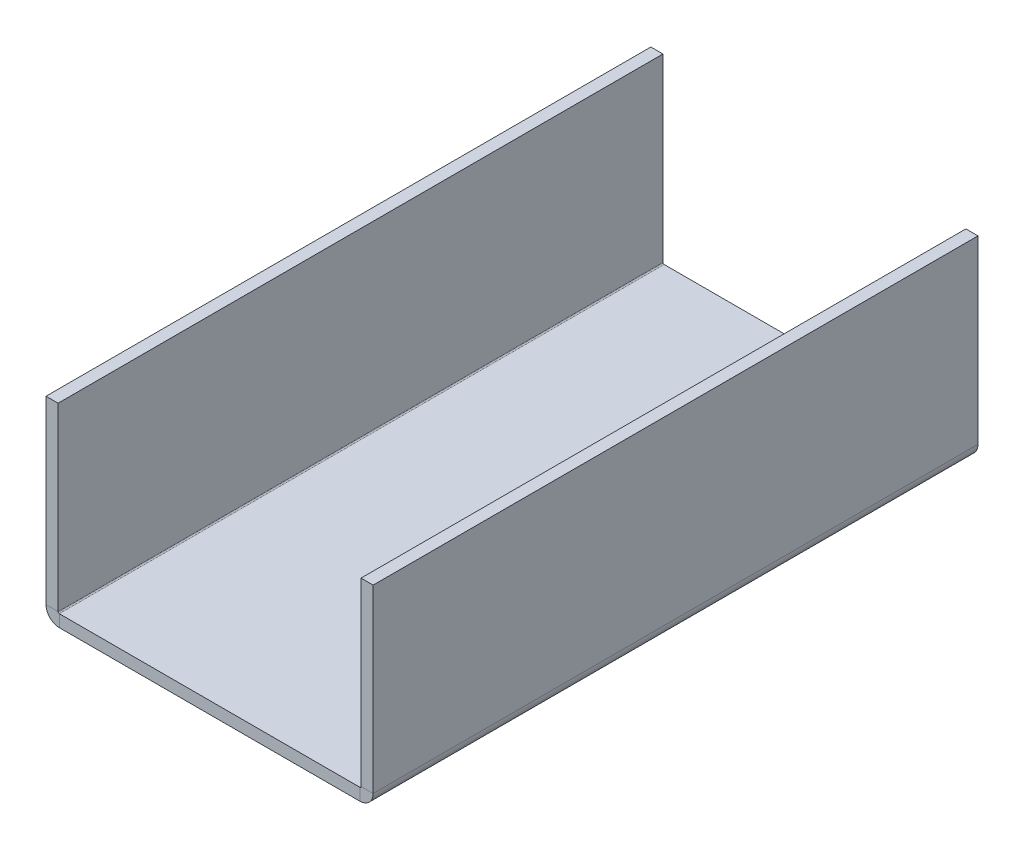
ISO-10303-21;
HEADER;
FILE_DESCRIPTION(('STEP AP214'),'2;1');
FILE_NAME('part.step','',(''),(''),'','','');
FILE_SCHEMA(('AUTOMOTIVE_DESIGN { 1 0 10303 214 1 1 1 1 }'));
ENDSEC;
DATA;
#1=APPLICATION_CONTEXT('core data for automotive mechanical design processes');
#2=APPLICATION_PROTOCOL_DEFINITION('international standard','automotive_design',2000,#1);
#3=PRODUCT_CONTEXT('',#1,'mechanical');
#4=PRODUCT('Part','Part','',(#3));
#5=PRODUCT_RELATED_PRODUCT_CATEGORY('part','',(#4));
#6=PRODUCT_DEFINITION_FORMATION('','',#4);
#7=PRODUCT_DEFINITION_CONTEXT('part definition',#1,'design');
#8=PRODUCT_DEFINITION('design','',#6,#7);
#9=PRODUCT_DEFINITION_SHAPE('','',#8);
#10=(LENGTH_UNIT() NAMED_UNIT(*) SI_UNIT(.MILLI.,.METRE.));
#11=(NAMED_UNIT(*) PLANE_ANGLE_UNIT() SI_UNIT($,.RADIAN.));
#12=(NAMED_UNIT(*) SI_UNIT($,.STERADIAN.) SOLID_ANGLE_UNIT());
#13=UNCERTAINTY_MEASURE_WITH_UNIT(LENGTH_MEASURE(1.E-05),#10,'distance_accuracy_value','');
#14=(GEOMETRIC_REPRESENTATION_CONTEXT(3) GLOBAL_UNCERTAINTY_ASSIGNED_CONTEXT((#13)) GLOBAL_UNIT_ASSIGNED_CONTEXT((#10,
#11,#12)) REPRESENTATION_CONTEXT('',''));
#15=CARTESIAN_POINT('',(0.,0.,0.));
#16=DIRECTION('',(0.,0.,1.));
#17=DIRECTION('',(1.,0.,0.));
#18=AXIS2_PLACEMENT_3D('',#15,#16,#17);
#19=CARTESIAN_POINT('',(0.,1.,-50.));
#20=DIRECTION('',(0.,-1.,0.));
#21=DIRECTION('',(0.,0.,-1.));
#22=AXIS2_PLACEMENT_3D('',#19,#20,#21);
#23=PLANE('',#22);
#24=DIRECTION('',(1.,0.,0.));
#25=VECTOR('',#24,1.);
#26=CARTESIAN_POINT('',(0.,1.,0.));
#27=LINE('',#26,#25);
#28=CARTESIAN_POINT('',(15.0785476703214,1.,0.));
#29=VERTEX_POINT('',#28);
#30=CARTESIAN_POINT('',(39.9214523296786,0.999999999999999,0.));
#31=VERTEX_POINT('',#30);
#32=EDGE_CURVE('E45',#29,#31,#27,.T.);
#33=ORIENTED_EDGE('',*,*,#32,.T.);
#34=DIRECTION('',(0.,0.,-1.));
#35=VECTOR('',#34,1.);
#36=CARTESIAN_POINT('',(39.9214523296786,1.,-50.));
#37=LINE('',#36,#35);
#38=CARTESIAN_POINT('',(39.9214523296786,0.999999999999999,-50.));
#39=VERTEX_POINT('',#38);
#40=EDGE_CURVE('E237',#31,#39,#37,.T.);
#41=ORIENTED_EDGE('',*,*,#40,.T.);
#42=DIRECTION('',(-1.,0.,0.));
#43=VECTOR('',#42,1.);
#44=CARTESIAN_POINT('',(0.,1.,-50.));
#45=LINE('',#44,#43);
#46=CARTESIAN_POINT('',(15.0785476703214,1.,-50.));
#47=VERTEX_POINT('',#46);
#48=EDGE_CURVE('E229',#39,#47,#45,.T.);
#49=ORIENTED_EDGE('',*,*,#48,.T.);
#50=DIRECTION('',(0.,0.,-1.));
#51=VECTOR('',#50,1.);
#52=CARTESIAN_POINT('',(15.0785476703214,1.,-50.));
#53=LINE('',#52,#51);
#54=EDGE_CURVE('E225',#29,#47,#53,.T.);
#55=ORIENTED_EDGE('',*,*,#54,.F.);
#56=EDGE_LOOP('',(#33,#41,#49,#55));
#57=FACE_BOUND('',#56,.T.);
#58=ADVANCED_FACE('F41',(#57),#23,.F.);
#59=CARTESIAN_POINT('',(0.,1.,-50.));
#60=DIRECTION('',(0.,0.,1.));
#61=DIRECTION('',(1.,0.,0.));
#62=AXIS2_PLACEMENT_3D('',#59,#60,#61);
#63=PLANE('',#62);
#64=ORIENTED_EDGE('',*,*,#48,.F.);
#65=DIRECTION('',(0.,-1.,0.));
#66=VECTOR('',#65,1.);
#67=CARTESIAN_POINT('',(39.9214523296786,1.,-50.));
#68=LINE('',#67,#66);
#69=CARTESIAN_POINT('',(39.9214523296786,0.,-50.));
#70=VERTEX_POINT('',#69);
#71=EDGE_CURVE('E12',#39,#70,#68,.T.);
#72=ORIENTED_EDGE('',*,*,#71,.T.);
#73=DIRECTION('',(-1.,0.,0.));
#74=VECTOR('',#73,1.);
#75=CARTESIAN_POINT('',(0.,0.,-50.));
#76=LINE('',#75,#74);
#77=CARTESIAN_POINT('',(15.0785476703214,0.,-50.));
#78=VERTEX_POINT('',#77);
#79=EDGE_CURVE('E244',#70,#78,#76,.T.);
#80=ORIENTED_EDGE('',*,*,#79,.T.);
#81=DIRECTION('',(0.,-1.,0.));
#82=VECTOR('',#81,1.);
#83=CARTESIAN_POINT('',(15.0785476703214,1.,-50.));
#84=LINE('',#83,#82);
#85=EDGE_CURVE('E228',#47,#78,#84,.T.);
#86=ORIENTED_EDGE('',*,*,#85,.F.);
#87=EDGE_LOOP('',(#64,#72,#80,#86));
#88=FACE_BOUND('',#87,.T.);
#89=ADVANCED_FACE('F43',(#88),#63,.F.);
#90=CARTESIAN_POINT('',(0.,1.,0.));
#91=DIRECTION('',(0.,0.,-1.));
#92=DIRECTION('',(-1.,0.,0.));
#93=AXIS2_PLACEMENT_3D('',#90,#91,#92);
#94=PLANE('',#93);
#95=DIRECTION('',(1.,0.,0.));
#96=VECTOR('',#95,1.);
#97=CARTESIAN_POINT('',(0.,0.,0.));
#98=LINE('',#97,#96);
#99=CARTESIAN_POINT('',(15.0785476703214,0.,0.));
#100=VERTEX_POINT('',#99);
#101=CARTESIAN_POINT('',(39.9214523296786,0.,0.));
#102=VERTEX_POINT('',#101);
#103=EDGE_CURVE('E64',#100,#102,#98,.T.);
#104=ORIENTED_EDGE('',*,*,#103,.T.);
#105=DIRECTION('',(0.,1.,0.));
#106=VECTOR('',#105,1.);
#107=CARTESIAN_POINT('',(39.9214523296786,1.,0.));
#108=LINE('',#107,#106);
#109=EDGE_CURVE('E240',#102,#31,#108,.T.);
#110=ORIENTED_EDGE('',*,*,#109,.T.);
#111=ORIENTED_EDGE('',*,*,#32,.F.);
#112=DIRECTION('',(0.,1.,0.));
#113=VECTOR('',#112,1.);
#114=CARTESIAN_POINT('',(15.0785476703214,1.,0.));
#115=LINE('',#114,#113);
#116=EDGE_CURVE('E234',#100,#29,#115,.T.);
#117=ORIENTED_EDGE('',*,*,#116,.F.);
#118=EDGE_LOOP('',(#104,#110,#111,#117));
#119=FACE_BOUND('',#118,.T.);
#120=ADVANCED_FACE('F253',(#119),#94,.F.);
#121=CARTESIAN_POINT('',(0.,0.,-50.));
#122=DIRECTION('',(0.,-1.,0.));
#123=DIRECTION('',(0.,0.,-1.));
#124=AXIS2_PLACEMENT_3D('',#121,#122,#123);
#125=PLANE('',#124);
#126=DIRECTION('',(0.,0.,-1.));
#127=VECTOR('',#126,1.);
#128=CARTESIAN_POINT('',(39.9214523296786,0.,-50.));
#129=LINE('',#128,#127);
#130=EDGE_CURVE('E50',#102,#70,#129,.T.);
#131=ORIENTED_EDGE('',*,*,#130,.F.);
#132=ORIENTED_EDGE('',*,*,#103,.F.);
#133=DIRECTION('',(0.,0.,-1.));
#134=VECTOR('',#133,1.);
#135=CARTESIAN_POINT('',(15.0785476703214,0.,-50.));
#136=LINE('',#135,#134);
#137=EDGE_CURVE('E232',#100,#78,#136,.T.);
#138=ORIENTED_EDGE('',*,*,#137,.T.);
#139=ORIENTED_EDGE('',*,*,#79,.F.);
#140=EDGE_LOOP('',(#131,#132,#138,#139));
#141=FACE_BOUND('',#140,.T.);
#142=ADVANCED_FACE('F299',(#141),#125,.T.);
#143=CARTESIAN_POINT('',(15.0785476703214,1.1,0.));
#144=DIRECTION('',(0.,0.,-1.));
#145=DIRECTION('',(-1.,0.,0.));
#146=AXIS2_PLACEMENT_3D('',#143,#144,#145);
#147=PLANE('',#146);
#148=DIRECTION('',(1.,0.,0.));
#149=VECTOR('',#148,1.);
#150=CARTESIAN_POINT('',(14.9785476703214,1.1,0.));
#151=LINE('',#150,#149);
#152=CARTESIAN_POINT('',(13.9785476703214,1.1,0.));
#153=VERTEX_POINT('',#152);
#154=CARTESIAN_POINT('',(14.9785476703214,1.1,0.));
#155=VERTEX_POINT('',#154);
#156=EDGE_CURVE('E186',#153,#155,#151,.T.);
#157=ORIENTED_EDGE('',*,*,#156,.F.);
#158=CARTESIAN_POINT('',(15.0785476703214,1.1,0.));
#159=DIRECTION('',(0.,0.,1.));
#160=DIRECTION('',(1.,0.,0.));
#161=AXIS2_PLACEMENT_3D('',#158,#159,#160);
#162=CIRCLE('',#161,1.1);
#163=EDGE_CURVE('E185',#153,#100,#162,.T.);
#164=ORIENTED_EDGE('',*,*,#163,.T.);
#165=ORIENTED_EDGE('',*,*,#116,.T.);
#166=CARTESIAN_POINT('',(15.0785476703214,1.1,0.));
#167=DIRECTION('',(0.,0.,1.));
#168=DIRECTION('',(1.,0.,0.));
#169=AXIS2_PLACEMENT_3D('',#166,#167,#168);
#170=CIRCLE('',#169,0.0999999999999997);
#171=EDGE_CURVE('E214',#155,#29,#170,.T.);
#172=ORIENTED_EDGE('',*,*,#171,.F.);
#173=EDGE_LOOP('',(#157,#164,#165,#172));
#174=FACE_BOUND('',#173,.T.);
#175=ADVANCED_FACE('F295',(#174),#147,.F.);
#176=CARTESIAN_POINT('',(15.0785476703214,1.1,-50.));
#177=DIRECTION('',(0.,0.,1.));
#178=DIRECTION('',(1.,0.,0.));
#179=AXIS2_PLACEMENT_3D('',#176,#177,#178);
#180=PLANE('',#179);
#181=ORIENTED_EDGE('',*,*,#85,.T.);
#182=CARTESIAN_POINT('',(15.0785476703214,1.1,-50.));
#183=DIRECTION('',(0.,0.,1.));
#184=DIRECTION('',(1.,0.,0.));
#185=AXIS2_PLACEMENT_3D('',#182,#183,#184);
#186=CIRCLE('',#185,1.1);
#187=CARTESIAN_POINT('',(13.9785476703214,1.1,-50.));
#188=VERTEX_POINT('',#187);
#189=EDGE_CURVE('E218',#78,#188,#186,.F.);
#190=ORIENTED_EDGE('',*,*,#189,.T.);
#191=DIRECTION('',(-1.,0.,0.));
#192=VECTOR('',#191,1.);
#193=CARTESIAN_POINT('',(14.9785476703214,1.1,-50.));
#194=LINE('',#193,#192);
#195=CARTESIAN_POINT('',(14.9785476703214,1.1,-50.));
#196=VERTEX_POINT('',#195);
#197=EDGE_CURVE('E193',#196,#188,#194,.T.);
#198=ORIENTED_EDGE('',*,*,#197,.F.);
#199=CARTESIAN_POINT('',(15.0785476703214,1.1,-50.));
#200=DIRECTION('',(0.,0.,-1.));
#201=DIRECTION('',(-1.,0.,0.));
#202=AXIS2_PLACEMENT_3D('',#199,#200,#201);
#203=CIRCLE('',#202,0.0999999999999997);
#204=EDGE_CURVE('E217',#47,#196,#203,.T.);
#205=ORIENTED_EDGE('',*,*,#204,.F.);
#206=EDGE_LOOP('',(#181,#190,#198,#205));
#207=FACE_BOUND('',#206,.T.);
#208=ADVANCED_FACE('F281',(#207),#180,.F.);
#209=CARTESIAN_POINT('',(15.0785476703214,1.1,-75.0102457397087));
#210=DIRECTION('',(0.,0.,1.));
#211=DIRECTION('',(1.,0.,0.));
#212=AXIS2_PLACEMENT_3D('',#209,#210,#211);
#213=CYLINDRICAL_SURFACE('',#212,0.1);
#214=ORIENTED_EDGE('',*,*,#204,.T.);
#215=DIRECTION('',(0.,0.,-1.));
#216=VECTOR('',#215,1.);
#217=CARTESIAN_POINT('',(14.9785476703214,1.1,-50.));
#218=LINE('',#217,#216);
#219=EDGE_CURVE('E201',#155,#196,#218,.T.);
#220=ORIENTED_EDGE('',*,*,#219,.F.);
#221=ORIENTED_EDGE('',*,*,#171,.T.);
#222=ORIENTED_EDGE('',*,*,#54,.T.);
#223=EDGE_LOOP('',(#214,#220,#221,#222));
#224=FACE_BOUND('',#223,.T.);
#225=ADVANCED_FACE('F277',(#224),#213,.F.);
#226=CARTESIAN_POINT('',(15.0785476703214,1.1,-75.0102457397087));
#227=DIRECTION('',(0.,0.,1.));
#228=DIRECTION('',(1.,0.,0.));
#229=AXIS2_PLACEMENT_3D('',#226,#227,#228);
#230=CYLINDRICAL_SURFACE('',#229,1.1);
#231=ORIENTED_EDGE('',*,*,#189,.F.);
#232=ORIENTED_EDGE('',*,*,#137,.F.);
#233=ORIENTED_EDGE('',*,*,#163,.F.);
#234=DIRECTION('',(0.,0.,-1.));
#235=VECTOR('',#234,1.);
#236=CARTESIAN_POINT('',(13.9785476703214,1.1,-50.));
#237=LINE('',#236,#235);
#238=EDGE_CURVE('E177',#153,#188,#237,.T.);
#239=ORIENTED_EDGE('',*,*,#238,.T.);
#240=EDGE_LOOP('',(#231,#232,#233,#239));
#241=FACE_BOUND('',#240,.T.);
#242=ADVANCED_FACE('F298',(#241),#230,.T.);
#243=CARTESIAN_POINT('',(14.9785476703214,16.0214523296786,0.));
#244=DIRECTION('',(0.,-1.,0.));
#245=DIRECTION('',(0.,0.,-1.));
#246=AXIS2_PLACEMENT_3D('',#243,#244,#245);
#247=PLANE('',#246);
#248=DIRECTION('',(0.,0.,1.));
#249=VECTOR('',#248,1.);
#250=CARTESIAN_POINT('',(13.9785476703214,16.0214523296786,0.));
#251=LINE('',#250,#249);
#252=CARTESIAN_POINT('',(13.9785476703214,16.0214523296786,-50.));
#253=VERTEX_POINT('',#252);
#254=CARTESIAN_POINT('',(13.9785476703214,16.0214523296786,0.));
#255=VERTEX_POINT('',#254);
#256=EDGE_CURVE('E209',#253,#255,#251,.T.);
#257=ORIENTED_EDGE('',*,*,#256,.T.);
#258=DIRECTION('',(-1.,0.,0.));
#259=VECTOR('',#258,1.);
#260=CARTESIAN_POINT('',(14.9785476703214,16.0214523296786,0.));
#261=LINE('',#260,#259);
#262=CARTESIAN_POINT('',(14.9785476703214,16.0214523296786,0.));
#263=VERTEX_POINT('',#262);
#264=EDGE_CURVE('E182',#263,#255,#261,.T.);
#265=ORIENTED_EDGE('',*,*,#264,.F.);
#266=DIRECTION('',(0.,0.,1.));
#267=VECTOR('',#266,1.);
#268=CARTESIAN_POINT('',(14.9785476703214,16.0214523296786,0.));
#269=LINE('',#268,#267);
#270=CARTESIAN_POINT('',(14.9785476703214,16.0214523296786,-50.));
#271=VERTEX_POINT('',#270);
#272=EDGE_CURVE('E196',#271,#263,#269,.T.);
#273=ORIENTED_EDGE('',*,*,#272,.F.);
#274=DIRECTION('',(-1.,0.,0.));
#275=VECTOR('',#274,1.);
#276=CARTESIAN_POINT('',(14.9785476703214,16.0214523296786,-50.));
#277=LINE('',#276,#275);
#278=EDGE_CURVE('E206',#271,#253,#277,.T.);
#279=ORIENTED_EDGE('',*,*,#278,.T.);
#280=EDGE_LOOP('',(#257,#265,#273,#279));
#281=FACE_BOUND('',#280,.T.);
#282=ADVANCED_FACE('F317',(#281),#247,.F.);
#283=CARTESIAN_POINT('',(14.9785476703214,16.0214523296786,-50.));
#284=DIRECTION('',(-1.,0.,0.));
#285=DIRECTION('',(0.,0.,-1.));
#286=AXIS2_PLACEMENT_3D('',#283,#284,#285);
#287=PLANE('',#286);
#288=DIRECTION('',(0.,-1.,0.));
#289=VECTOR('',#288,1.);
#290=CARTESIAN_POINT('',(14.9785476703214,16.0214523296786,0.));
#291=LINE('',#290,#289);
#292=EDGE_CURVE('E204',#263,#155,#291,.T.);
#293=ORIENTED_EDGE('',*,*,#292,.T.);
#294=ORIENTED_EDGE('',*,*,#219,.T.);
#295=DIRECTION('',(0.,1.,0.));
#296=VECTOR('',#295,1.);
#297=CARTESIAN_POINT('',(14.9785476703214,16.0214523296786,-50.));
#298=LINE('',#297,#296);
#299=EDGE_CURVE('E199',#196,#271,#298,.T.);
#300=ORIENTED_EDGE('',*,*,#299,.T.);
#301=ORIENTED_EDGE('',*,*,#272,.T.);
#302=EDGE_LOOP('',(#293,#294,#300,#301));
#303=FACE_BOUND('',#302,.T.);
#304=ADVANCED_FACE('F287',(#303),#287,.F.);
#305=CARTESIAN_POINT('',(14.9785476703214,16.0214523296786,-50.));
#306=DIRECTION('',(0.,0.,1.));
#307=DIRECTION('',(0.,-1.,0.));
#308=AXIS2_PLACEMENT_3D('',#305,#306,#307);
#309=PLANE('',#308);
#310=ORIENTED_EDGE('',*,*,#299,.F.);
#311=ORIENTED_EDGE('',*,*,#197,.T.);
#312=DIRECTION('',(0.,1.,0.));
#313=VECTOR('',#312,1.);
#314=CARTESIAN_POINT('',(13.9785476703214,16.0214523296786,-50.));
#315=LINE('',#314,#313);
#316=EDGE_CURVE('E191',#188,#253,#315,.T.);
#317=ORIENTED_EDGE('',*,*,#316,.T.);
#318=ORIENTED_EDGE('',*,*,#278,.F.);
#319=EDGE_LOOP('',(#310,#311,#317,#318));
#320=FACE_BOUND('',#319,.T.);
#321=ADVANCED_FACE('F283',(#320),#309,.F.);
#322=CARTESIAN_POINT('',(13.9785476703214,16.0214523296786,-50.));
#323=DIRECTION('',(-1.,0.,0.));
#324=DIRECTION('',(0.,0.,-1.));
#325=AXIS2_PLACEMENT_3D('',#322,#323,#324);
#326=PLANE('',#325);
#327=ORIENTED_EDGE('',*,*,#238,.F.);
#328=DIRECTION('',(0.,-1.,0.));
#329=VECTOR('',#328,1.);
#330=CARTESIAN_POINT('',(13.9785476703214,16.0214523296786,0.));
#331=LINE('',#330,#329);
#332=EDGE_CURVE('E189',#255,#153,#331,.T.);
#333=ORIENTED_EDGE('',*,*,#332,.F.);
#334=ORIENTED_EDGE('',*,*,#256,.F.);
#335=ORIENTED_EDGE('',*,*,#316,.F.);
#336=EDGE_LOOP('',(#327,#333,#334,#335));
#337=FACE_BOUND('',#336,.T.);
#338=ADVANCED_FACE('F322',(#337),#326,.T.);
#339=CARTESIAN_POINT('',(14.9785476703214,16.0214523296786,0.));
#340=DIRECTION('',(0.,0.,-1.));
#341=DIRECTION('',(0.,1.,0.));
#342=AXIS2_PLACEMENT_3D('',#339,#340,#341);
#343=PLANE('',#342);
#344=ORIENTED_EDGE('',*,*,#332,.T.);
#345=ORIENTED_EDGE('',*,*,#156,.T.);
#346=ORIENTED_EDGE('',*,*,#292,.F.);
#347=ORIENTED_EDGE('',*,*,#264,.T.);
#348=EDGE_LOOP('',(#344,#345,#346,#347));
#349=FACE_BOUND('',#348,.T.);
#350=ADVANCED_FACE('F291',(#349),#343,.F.);
#351=CARTESIAN_POINT('',(39.9214523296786,1.1,0.));
#352=DIRECTION('',(0.,0.,-1.));
#353=DIRECTION('',(-1.,0.,0.));
#354=AXIS2_PLACEMENT_3D('',#351,#352,#353);
#355=PLANE('',#354);
#356=ORIENTED_EDGE('',*,*,#109,.F.);
#357=CARTESIAN_POINT('',(39.9214523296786,1.1,0.));
#358=DIRECTION('',(0.,0.,-1.));
#359=DIRECTION('',(-1.,0.,0.));
#360=AXIS2_PLACEMENT_3D('',#357,#358,#359);
#361=CIRCLE('',#360,1.1);
#362=CARTESIAN_POINT('',(41.0214523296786,1.10000000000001,0.));
#363=VERTEX_POINT('',#362);
#364=EDGE_CURVE('E179',#102,#363,#361,.F.);
#365=ORIENTED_EDGE('',*,*,#364,.T.);
#366=DIRECTION('',(-1.,0.,0.));
#367=VECTOR('',#366,1.);
#368=CARTESIAN_POINT('',(40.0214523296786,1.1,0.));
#369=LINE('',#368,#367);
#370=CARTESIAN_POINT('',(40.0214523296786,1.1,0.));
#371=VERTEX_POINT('',#370);
#372=EDGE_CURVE('E141',#363,#371,#369,.T.);
#373=ORIENTED_EDGE('',*,*,#372,.T.);
#374=CARTESIAN_POINT('',(39.9214523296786,1.1,0.));
#375=DIRECTION('',(0.,0.,1.));
#376=DIRECTION('',(1.,0.,0.));
#377=AXIS2_PLACEMENT_3D('',#374,#375,#376);
#378=CIRCLE('',#377,0.100000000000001);
#379=EDGE_CURVE('E170',#31,#371,#378,.T.);
#380=ORIENTED_EDGE('',*,*,#379,.F.);
#381=EDGE_LOOP('',(#356,#365,#373,#380));
#382=FACE_BOUND('',#381,.T.);
#383=ADVANCED_FACE('F255',(#382),#355,.F.);
#384=CARTESIAN_POINT('',(39.9214523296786,1.1,-50.));
#385=DIRECTION('',(0.,0.,1.));
#386=DIRECTION('',(1.,0.,0.));
#387=AXIS2_PLACEMENT_3D('',#384,#385,#386);
#388=PLANE('',#387);
#389=DIRECTION('',(1.,0.,0.));
#390=VECTOR('',#389,1.);
#391=CARTESIAN_POINT('',(40.0214523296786,1.1,-50.));
#392=LINE('',#391,#390);
#393=CARTESIAN_POINT('',(40.0214523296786,1.1,-50.));
#394=VERTEX_POINT('',#393);
#395=CARTESIAN_POINT('',(41.0214523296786,1.10000000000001,-50.));
#396=VERTEX_POINT('',#395);
#397=EDGE_CURVE('E161',#394,#396,#392,.T.);
#398=ORIENTED_EDGE('',*,*,#397,.T.);
#399=CARTESIAN_POINT('',(39.9214523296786,1.1,-50.));
#400=DIRECTION('',(0.,0.,-1.));
#401=DIRECTION('',(-1.,0.,0.));
#402=AXIS2_PLACEMENT_3D('',#399,#400,#401);
#403=CIRCLE('',#402,1.1);
#404=EDGE_CURVE('E174',#396,#70,#403,.T.);
#405=ORIENTED_EDGE('',*,*,#404,.T.);
#406=ORIENTED_EDGE('',*,*,#71,.F.);
#407=CARTESIAN_POINT('',(39.9214523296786,1.1,-50.));
#408=DIRECTION('',(0.,0.,-1.));
#409=DIRECTION('',(-1.,0.,0.));
#410=AXIS2_PLACEMENT_3D('',#407,#408,#409);
#411=CIRCLE('',#410,0.100000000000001);
#412=EDGE_CURVE('E173',#394,#39,#411,.T.);
#413=ORIENTED_EDGE('',*,*,#412,.F.);
#414=EDGE_LOOP('',(#398,#405,#406,#413));
#415=FACE_BOUND('',#414,.T.);
#416=ADVANCED_FACE('F270',(#415),#388,.F.);
#417=CARTESIAN_POINT('',(39.9214523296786,1.1,25.0102457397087));
#418=DIRECTION('',(0.,0.,-1.));
#419=DIRECTION('',(-1.,0.,0.));
#420=AXIS2_PLACEMENT_3D('',#417,#418,#419);
#421=CYLINDRICAL_SURFACE('',#420,0.1);
#422=ORIENTED_EDGE('',*,*,#412,.T.);
#423=ORIENTED_EDGE('',*,*,#40,.F.);
#424=ORIENTED_EDGE('',*,*,#379,.T.);
#425=DIRECTION('',(0.,0.,-1.));
#426=VECTOR('',#425,1.);
#427=CARTESIAN_POINT('',(40.0214523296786,1.1,-50.));
#428=LINE('',#427,#426);
#429=EDGE_CURVE('E167',#371,#394,#428,.T.);
#430=ORIENTED_EDGE('',*,*,#429,.T.);
#431=EDGE_LOOP('',(#422,#423,#424,#430));
#432=FACE_BOUND('',#431,.T.);
#433=ADVANCED_FACE('F267',(#432),#421,.F.);
#434=CARTESIAN_POINT('',(39.9214523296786,1.1,25.0102457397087));
#435=DIRECTION('',(0.,0.,-1.));
#436=DIRECTION('',(-1.,0.,0.));
#437=AXIS2_PLACEMENT_3D('',#434,#435,#436);
#438=CYLINDRICAL_SURFACE('',#437,1.1);
#439=ORIENTED_EDGE('',*,*,#404,.F.);
#440=DIRECTION('',(0.,0.,-1.));
#441=VECTOR('',#440,1.);
#442=CARTESIAN_POINT('',(41.0214523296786,1.10000000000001,-50.));
#443=LINE('',#442,#441);
#444=EDGE_CURVE('E146',#363,#396,#443,.T.);
#445=ORIENTED_EDGE('',*,*,#444,.F.);
#446=ORIENTED_EDGE('',*,*,#364,.F.);
#447=ORIENTED_EDGE('',*,*,#130,.T.);
#448=EDGE_LOOP('',(#439,#445,#446,#447));
#449=FACE_BOUND('',#448,.T.);
#450=ADVANCED_FACE('F256',(#449),#438,.T.);
#451=CARTESIAN_POINT('',(40.0214523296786,16.0214523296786,0.));
#452=DIRECTION('',(0.,-1.,0.));
#453=DIRECTION('',(0.,0.,1.));
#454=AXIS2_PLACEMENT_3D('',#451,#452,#453);
#455=PLANE('',#454);
#456=DIRECTION('',(0.,0.,-1.));
#457=VECTOR('',#456,1.);
#458=CARTESIAN_POINT('',(41.0214523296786,16.0214523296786,0.));
#459=LINE('',#458,#457);
#460=CARTESIAN_POINT('',(41.0214523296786,16.0214523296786,0.));
#461=VERTEX_POINT('',#460);
#462=CARTESIAN_POINT('',(41.0214523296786,16.0214523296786,-50.));
#463=VERTEX_POINT('',#462);
#464=EDGE_CURVE('E152',#461,#463,#459,.T.);
#465=ORIENTED_EDGE('',*,*,#464,.T.);
#466=DIRECTION('',(1.,0.,0.));
#467=VECTOR('',#466,1.);
#468=CARTESIAN_POINT('',(40.0214523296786,16.0214523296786,-50.));
#469=LINE('',#468,#467);
#470=CARTESIAN_POINT('',(40.0214523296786,16.0214523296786,-50.));
#471=VERTEX_POINT('',#470);
#472=EDGE_CURVE('E257',#471,#463,#469,.T.);
#473=ORIENTED_EDGE('',*,*,#472,.F.);
#474=DIRECTION('',(0.,0.,-1.));
#475=VECTOR('',#474,1.);
#476=CARTESIAN_POINT('',(40.0214523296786,16.0214523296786,0.));
#477=LINE('',#476,#475);
#478=CARTESIAN_POINT('',(40.0214523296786,16.0214523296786,0.));
#479=VERTEX_POINT('',#478);
#480=EDGE_CURVE('E154',#479,#471,#477,.T.);
#481=ORIENTED_EDGE('',*,*,#480,.F.);
#482=DIRECTION('',(1.,0.,0.));
#483=VECTOR('',#482,1.);
#484=CARTESIAN_POINT('',(40.0214523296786,16.0214523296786,0.));
#485=LINE('',#484,#483);
#486=EDGE_CURVE('E138',#479,#461,#485,.T.);
#487=ORIENTED_EDGE('',*,*,#486,.T.);
#488=EDGE_LOOP('',(#465,#473,#481,#487));
#489=FACE_BOUND('',#488,.T.);
#490=ADVANCED_FACE('F150',(#489),#455,.F.);
#491=CARTESIAN_POINT('',(40.0214523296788,-38.9785476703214,-50.));
#492=DIRECTION('',(1.,0.,0.));
#493=DIRECTION('',(0.,0.,-1.));
#494=AXIS2_PLACEMENT_3D('',#491,#492,#493);
#495=PLANE('',#494);
#496=ORIENTED_EDGE('',*,*,#429,.F.);
#497=DIRECTION('',(0.,1.,0.));
#498=VECTOR('',#497,1.);
#499=CARTESIAN_POINT('',(40.0214523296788,-38.9785476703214,0.));
#500=LINE('',#499,#498);
#501=EDGE_CURVE('E155',#371,#479,#500,.T.);
#502=ORIENTED_EDGE('',*,*,#501,.T.);
#503=ORIENTED_EDGE('',*,*,#480,.T.);
#504=DIRECTION('',(0.,-1.,0.));
#505=VECTOR('',#504,1.);
#506=CARTESIAN_POINT('',(40.0214523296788,-38.9785476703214,-50.));
#507=LINE('',#506,#505);
#508=EDGE_CURVE('E147',#471,#394,#507,.T.);
#509=ORIENTED_EDGE('',*,*,#508,.T.);
#510=EDGE_LOOP('',(#496,#502,#503,#509));
#511=FACE_BOUND('',#510,.T.);
#512=ADVANCED_FACE('F265',(#511),#495,.F.);
#513=CARTESIAN_POINT('',(40.0214523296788,-38.9785476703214,0.));
#514=DIRECTION('',(0.,0.,-1.));
#515=DIRECTION('',(0.,-1.,0.));
#516=AXIS2_PLACEMENT_3D('',#513,#514,#515);
#517=PLANE('',#516);
#518=ORIENTED_EDGE('',*,*,#372,.F.);
#519=DIRECTION('',(0.,1.,0.));
#520=VECTOR('',#519,1.);
#521=CARTESIAN_POINT('',(41.0214523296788,-38.9785476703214,0.));
#522=LINE('',#521,#520);
#523=EDGE_CURVE('E134',#363,#461,#522,.T.);
#524=ORIENTED_EDGE('',*,*,#523,.T.);
#525=ORIENTED_EDGE('',*,*,#486,.F.);
#526=ORIENTED_EDGE('',*,*,#501,.F.);
#527=EDGE_LOOP('',(#518,#524,#525,#526));
#528=FACE_BOUND('',#527,.T.);
#529=ADVANCED_FACE('F136',(#528),#517,.F.);
#530=CARTESIAN_POINT('',(41.0214523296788,-38.9785476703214,-50.));
#531=DIRECTION('',(1.,0.,0.));
#532=DIRECTION('',(0.,0.,-1.));
#533=AXIS2_PLACEMENT_3D('',#530,#531,#532);
#534=PLANE('',#533);
#535=ORIENTED_EDGE('',*,*,#523,.F.);
#536=ORIENTED_EDGE('',*,*,#444,.T.);
#537=DIRECTION('',(0.,-1.,0.));
#538=VECTOR('',#537,1.);
#539=CARTESIAN_POINT('',(41.0214523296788,-38.9785476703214,-50.));
#540=LINE('',#539,#538);
#541=EDGE_CURVE('E159',#463,#396,#540,.T.);
#542=ORIENTED_EDGE('',*,*,#541,.F.);
#543=ORIENTED_EDGE('',*,*,#464,.F.);
#544=EDGE_LOOP('',(#535,#536,#542,#543));
#545=FACE_BOUND('',#544,.T.);
#546=ADVANCED_FACE('F158',(#545),#534,.T.);
#547=CARTESIAN_POINT('',(40.0214523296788,-38.9785476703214,-50.));
#548=DIRECTION('',(0.,0.,1.));
#549=DIRECTION('',(0.,1.,0.));
#550=AXIS2_PLACEMENT_3D('',#547,#548,#549);
#551=PLANE('',#550);
#552=ORIENTED_EDGE('',*,*,#397,.F.);
#553=ORIENTED_EDGE('',*,*,#508,.F.);
#554=ORIENTED_EDGE('',*,*,#472,.T.);
#555=ORIENTED_EDGE('',*,*,#541,.T.);
#556=EDGE_LOOP('',(#552,#553,#554,#555));
#557=FACE_BOUND('',#556,.T.);
#558=ADVANCED_FACE('F341',(#557),#551,.F.);
#559=CLOSED_SHELL('',(#58,#89,#120,#142,#175,#208,#225,#242,#282,#304,#321,#338,#350,#383,#416,
#433,#450,#490,#512,#529,#546,#558));
#560=MANIFOLD_SOLID_BREP('B2',#559);
#561=ADVANCED_BREP_SHAPE_REPRESENTATION('',(#18,#560),#14);
#562=SHAPE_DEFINITION_REPRESENTATION(#9,#561);
ENDSEC;
END-ISO-10303-21;
